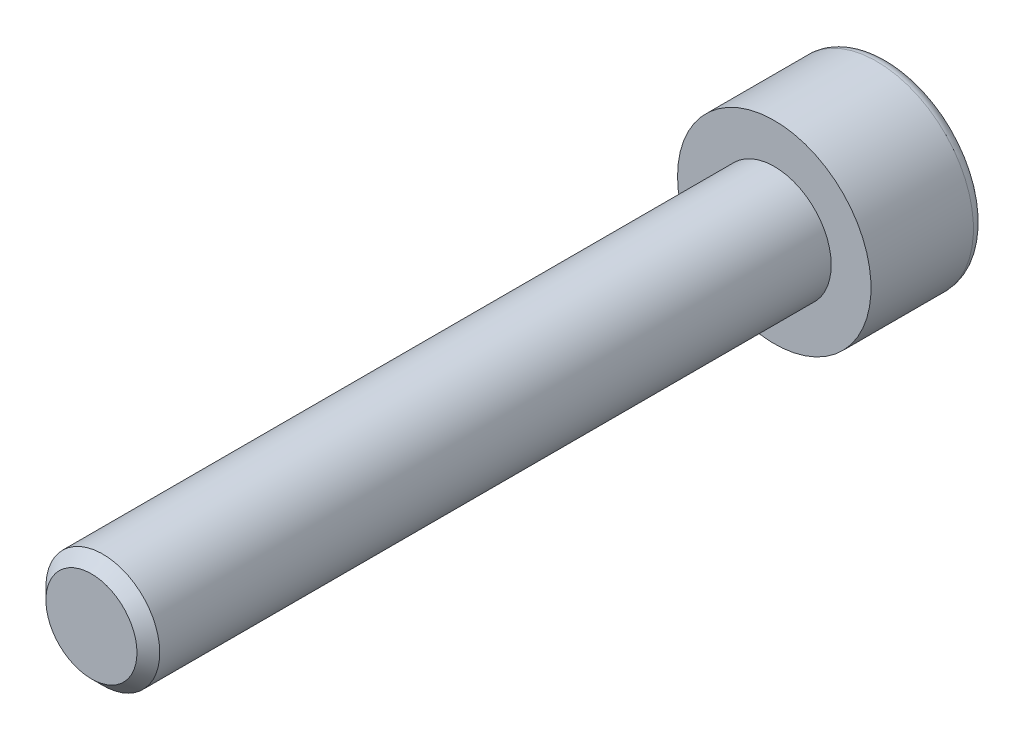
from build123d import *

# Parameters (mm, degrees)
ENLEV_MAT_EXTRU1_DEPTH = 2.5
ESQUISSE3_W            = 2.5
ESQUISSE3_H            = 30
CHANFREIN1_SIZE        = 0.5


with BuildPart() as part:
    # Esquisse1 → Base-R_volution (revolve)
    with BuildSketch(Plane(origin=(0, 0, 0), x_dir=(1, 0, 0), z_dir=(0, 1, 0)), mode=Mode.PRIVATE) as base_r_volution_sk:
        with BuildLine():
            Line((0, 0), (4.25, 0))
            Line((4.25, 0), (4.25, 4.5))
            ThreePointArc((4.25, 4.5), (4.103553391, 4.853553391), (3.75, 5))
            Line((3.75, 5), (0, 5))
            Line((0, 5), (0, 0))
        make_face()
    revolve(base_r_volution_sk.sketch.rotate(Axis((0, 0, 0), (0, 0, -1)), 180), axis=Axis((0, 0, 0), (0, 0, -1)))

    # Esquisse2 → enlev-mat-Extru1 (cut)
    with BuildSketch(Plane.XY.offset(-5)):
        Polygon((2, -1.154700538), (2, 1.154700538), (0, 2.309401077), (-2, 1.154700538), (-2, -1.154700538), (0, -2.309401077), align=None)
    extrude(amount=ENLEV_MAT_EXTRU1_DEPTH, mode=Mode.SUBTRACT)

    # Esquisse3 → Boss.-R_vol.1 (revolve)
    with BuildSketch(Plane(origin=(0, 0, 0), x_dir=(1, 0, 0), z_dir=(0, 1, 0))):
        with Locations((1.25, -15)):
            Rectangle(ESQUISSE3_W, ESQUISSE3_H)
    revolve(axis=Axis((0, 0, 0), (0, 0, 1)))

    # Chanfrein1
    chanfrein1_edges = [part.edges().sort_by_distance(p)[0] for p in [
        (-2.5, 0, 30),
    ]]
    chamfer(chanfrein1_edges, length=CHANFREIN1_SIZE)


solid = part.part
